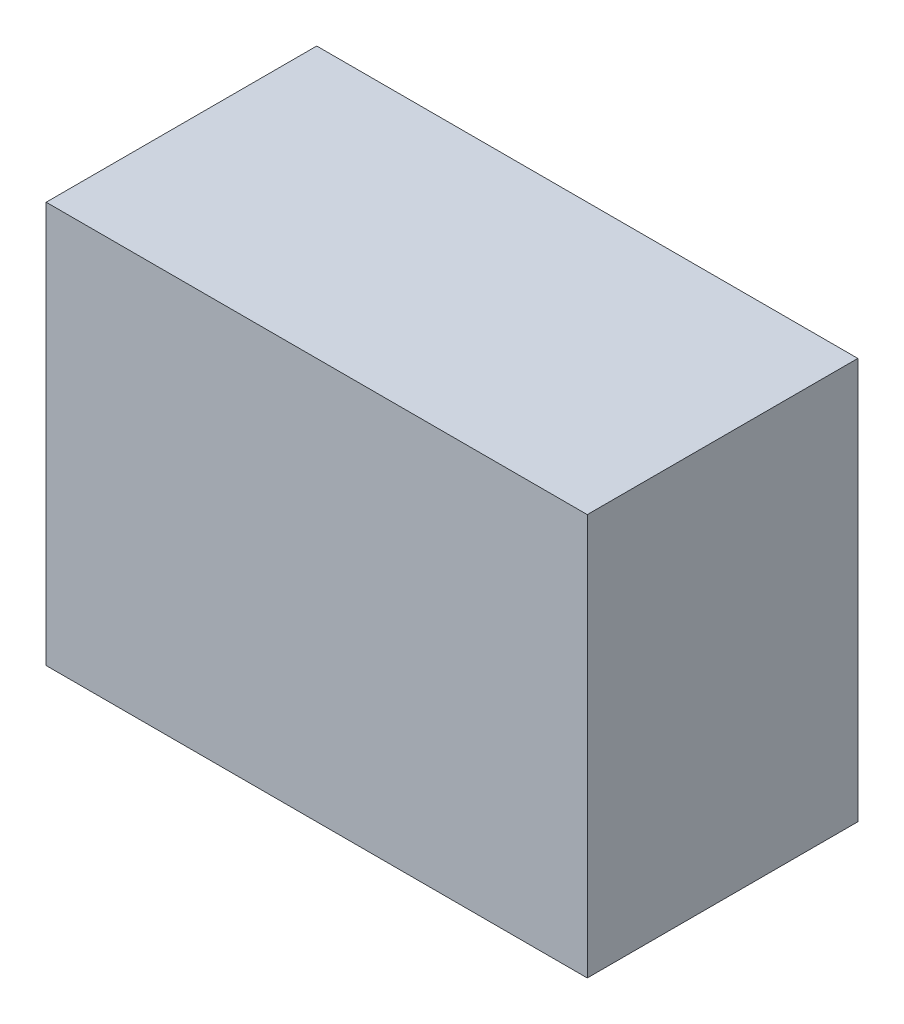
ISO-10303-21;
HEADER;
FILE_DESCRIPTION(('STEP AP214'),'2;1');
FILE_NAME('part.step','',(''),(''),'','','');
FILE_SCHEMA(('AUTOMOTIVE_DESIGN { 1 0 10303 214 1 1 1 1 }'));
ENDSEC;
DATA;
#1=APPLICATION_CONTEXT('core data for automotive mechanical design processes');
#2=APPLICATION_PROTOCOL_DEFINITION('international standard','automotive_design',2000,#1);
#3=PRODUCT_CONTEXT('',#1,'mechanical');
#4=PRODUCT('Part','Part','',(#3));
#5=PRODUCT_RELATED_PRODUCT_CATEGORY('part','',(#4));
#6=PRODUCT_DEFINITION_FORMATION('','',#4);
#7=PRODUCT_DEFINITION_CONTEXT('part definition',#1,'design');
#8=PRODUCT_DEFINITION('design','',#6,#7);
#9=PRODUCT_DEFINITION_SHAPE('','',#8);
#10=(LENGTH_UNIT() NAMED_UNIT(*) SI_UNIT(.MILLI.,.METRE.));
#11=(NAMED_UNIT(*) PLANE_ANGLE_UNIT() SI_UNIT($,.RADIAN.));
#12=(NAMED_UNIT(*) SI_UNIT($,.STERADIAN.) SOLID_ANGLE_UNIT());
#13=UNCERTAINTY_MEASURE_WITH_UNIT(LENGTH_MEASURE(1.E-05),#10,'distance_accuracy_value','');
#14=(GEOMETRIC_REPRESENTATION_CONTEXT(3) GLOBAL_UNCERTAINTY_ASSIGNED_CONTEXT((#13)) GLOBAL_UNIT_ASSIGNED_CONTEXT((#10,
#11,#12)) REPRESENTATION_CONTEXT('',''));
#15=CARTESIAN_POINT('',(0.,0.,0.));
#16=DIRECTION('',(0.,0.,1.));
#17=DIRECTION('',(1.,0.,0.));
#18=AXIS2_PLACEMENT_3D('',#15,#16,#17);
#19=CARTESIAN_POINT('',(0.,0.,0.));
#20=DIRECTION('',(0.,-1.,0.));
#21=DIRECTION('',(0.,0.,-1.));
#22=AXIS2_PLACEMENT_3D('',#19,#20,#21);
#23=PLANE('',#22);
#24=DIRECTION('',(0.,0.,-1.));
#25=VECTOR('',#24,1.);
#26=CARTESIAN_POINT('',(3.,0.,1.5));
#27=LINE('',#26,#25);
#28=CARTESIAN_POINT('',(3.,0.,1.5));
#29=VERTEX_POINT('',#28);
#30=CARTESIAN_POINT('',(3.,0.,-1.5));
#31=VERTEX_POINT('',#30);
#32=EDGE_CURVE('E79',#29,#31,#27,.T.);
#33=ORIENTED_EDGE('',*,*,#32,.F.);
#34=DIRECTION('',(1.,0.,0.));
#35=VECTOR('',#34,1.);
#36=CARTESIAN_POINT('',(-3.,0.,1.5));
#37=LINE('',#36,#35);
#38=CARTESIAN_POINT('',(-3.,0.,1.5));
#39=VERTEX_POINT('',#38);
#40=EDGE_CURVE('E20',#39,#29,#37,.T.);
#41=ORIENTED_EDGE('',*,*,#40,.F.);
#42=DIRECTION('',(0.,0.,1.));
#43=VECTOR('',#42,1.);
#44=CARTESIAN_POINT('',(-3.,0.,1.5));
#45=LINE('',#44,#43);
#46=CARTESIAN_POINT('',(-3.,0.,-1.5));
#47=VERTEX_POINT('',#46);
#48=EDGE_CURVE('E109',#47,#39,#45,.T.);
#49=ORIENTED_EDGE('',*,*,#48,.F.);
#50=DIRECTION('',(-1.,0.,0.));
#51=VECTOR('',#50,1.);
#52=CARTESIAN_POINT('',(-3.,0.,-1.5));
#53=LINE('',#52,#51);
#54=EDGE_CURVE('E83',#31,#47,#53,.T.);
#55=ORIENTED_EDGE('',*,*,#54,.F.);
#56=EDGE_LOOP('',(#33,#41,#49,#55));
#57=FACE_BOUND('',#56,.T.);
#58=ADVANCED_FACE('F17',(#57),#23,.T.);
#59=CARTESIAN_POINT('',(0.,4.45,0.));
#60=DIRECTION('',(0.,-1.,0.));
#61=DIRECTION('',(0.,0.,-1.));
#62=AXIS2_PLACEMENT_3D('',#59,#60,#61);
#63=PLANE('',#62);
#64=DIRECTION('',(0.,0.,-1.));
#65=VECTOR('',#64,1.);
#66=CARTESIAN_POINT('',(3.,4.45,1.5));
#67=LINE('',#66,#65);
#68=CARTESIAN_POINT('',(3.,4.45,1.5));
#69=VERTEX_POINT('',#68);
#70=CARTESIAN_POINT('',(3.,4.45,-1.5));
#71=VERTEX_POINT('',#70);
#72=EDGE_CURVE('E81',#69,#71,#67,.T.);
#73=ORIENTED_EDGE('',*,*,#72,.T.);
#74=DIRECTION('',(-1.,0.,0.));
#75=VECTOR('',#74,1.);
#76=CARTESIAN_POINT('',(-3.,4.45,-1.5));
#77=LINE('',#76,#75);
#78=CARTESIAN_POINT('',(-3.,4.45,-1.5));
#79=VERTEX_POINT('',#78);
#80=EDGE_CURVE('E105',#71,#79,#77,.T.);
#81=ORIENTED_EDGE('',*,*,#80,.T.);
#82=DIRECTION('',(0.,0.,1.));
#83=VECTOR('',#82,1.);
#84=CARTESIAN_POINT('',(-3.,4.45,1.5));
#85=LINE('',#84,#83);
#86=CARTESIAN_POINT('',(-3.,4.45,1.5));
#87=VERTEX_POINT('',#86);
#88=EDGE_CURVE('E74',#79,#87,#85,.T.);
#89=ORIENTED_EDGE('',*,*,#88,.T.);
#90=DIRECTION('',(1.,0.,0.));
#91=VECTOR('',#90,1.);
#92=CARTESIAN_POINT('',(-3.,4.45,1.5));
#93=LINE('',#92,#91);
#94=EDGE_CURVE('E11',#87,#69,#93,.T.);
#95=ORIENTED_EDGE('',*,*,#94,.T.);
#96=EDGE_LOOP('',(#73,#81,#89,#95));
#97=FACE_BOUND('',#96,.T.);
#98=ADVANCED_FACE('F146',(#97),#63,.F.);
#99=CARTESIAN_POINT('',(-3.,4.45,1.5));
#100=DIRECTION('',(0.,0.,-1.));
#101=DIRECTION('',(0.,-1.,0.));
#102=AXIS2_PLACEMENT_3D('',#99,#100,#101);
#103=PLANE('',#102);
#104=ORIENTED_EDGE('',*,*,#40,.T.);
#105=DIRECTION('',(0.,-1.,0.));
#106=VECTOR('',#105,1.);
#107=CARTESIAN_POINT('',(3.,4.45,1.5));
#108=LINE('',#107,#106);
#109=EDGE_CURVE('E66',#69,#29,#108,.T.);
#110=ORIENTED_EDGE('',*,*,#109,.F.);
#111=ORIENTED_EDGE('',*,*,#94,.F.);
#112=DIRECTION('',(0.,-1.,0.));
#113=VECTOR('',#112,1.);
#114=CARTESIAN_POINT('',(-3.,4.45,1.5));
#115=LINE('',#114,#113);
#116=EDGE_CURVE('E69',#87,#39,#115,.T.);
#117=ORIENTED_EDGE('',*,*,#116,.T.);
#118=EDGE_LOOP('',(#104,#110,#111,#117));
#119=FACE_BOUND('',#118,.T.);
#120=ADVANCED_FACE('F65',(#119),#103,.F.);
#121=CARTESIAN_POINT('',(-3.,4.45,1.5));
#122=DIRECTION('',(1.,0.,0.));
#123=DIRECTION('',(0.,1.,0.));
#124=AXIS2_PLACEMENT_3D('',#121,#122,#123);
#125=PLANE('',#124);
#126=ORIENTED_EDGE('',*,*,#48,.T.);
#127=ORIENTED_EDGE('',*,*,#116,.F.);
#128=ORIENTED_EDGE('',*,*,#88,.F.);
#129=DIRECTION('',(0.,-1.,0.));
#130=VECTOR('',#129,1.);
#131=CARTESIAN_POINT('',(-3.,4.45,-1.5));
#132=LINE('',#131,#130);
#133=EDGE_CURVE('E99',#79,#47,#132,.T.);
#134=ORIENTED_EDGE('',*,*,#133,.T.);
#135=EDGE_LOOP('',(#126,#127,#128,#134));
#136=FACE_BOUND('',#135,.T.);
#137=ADVANCED_FACE('F145',(#136),#125,.F.);
#138=CARTESIAN_POINT('',(-3.,4.45,-1.5));
#139=DIRECTION('',(0.,0.,1.));
#140=DIRECTION('',(1.,0.,0.));
#141=AXIS2_PLACEMENT_3D('',#138,#139,#140);
#142=PLANE('',#141);
#143=ORIENTED_EDGE('',*,*,#54,.T.);
#144=ORIENTED_EDGE('',*,*,#133,.F.);
#145=ORIENTED_EDGE('',*,*,#80,.F.);
#146=DIRECTION('',(0.,-1.,0.));
#147=VECTOR('',#146,1.);
#148=CARTESIAN_POINT('',(3.,4.45,-1.5));
#149=LINE('',#148,#147);
#150=EDGE_CURVE('E88',#71,#31,#149,.T.);
#151=ORIENTED_EDGE('',*,*,#150,.T.);
#152=EDGE_LOOP('',(#143,#144,#145,#151));
#153=FACE_BOUND('',#152,.T.);
#154=ADVANCED_FACE('F133',(#153),#142,.F.);
#155=CARTESIAN_POINT('',(3.,4.45,1.5));
#156=DIRECTION('',(-1.,0.,0.));
#157=DIRECTION('',(0.,0.,1.));
#158=AXIS2_PLACEMENT_3D('',#155,#156,#157);
#159=PLANE('',#158);
#160=ORIENTED_EDGE('',*,*,#32,.T.);
#161=ORIENTED_EDGE('',*,*,#150,.F.);
#162=ORIENTED_EDGE('',*,*,#72,.F.);
#163=ORIENTED_EDGE('',*,*,#109,.T.);
#164=EDGE_LOOP('',(#160,#161,#162,#163));
#165=FACE_BOUND('',#164,.T.);
#166=ADVANCED_FACE('F77',(#165),#159,.F.);
#167=CLOSED_SHELL('',(#58,#98,#120,#137,#154,#166));
#168=MANIFOLD_SOLID_BREP('B1',#167);
#169=ADVANCED_BREP_SHAPE_REPRESENTATION('',(#18,#168),#14);
#170=SHAPE_DEFINITION_REPRESENTATION(#9,#169);
ENDSEC;
END-ISO-10303-21;
